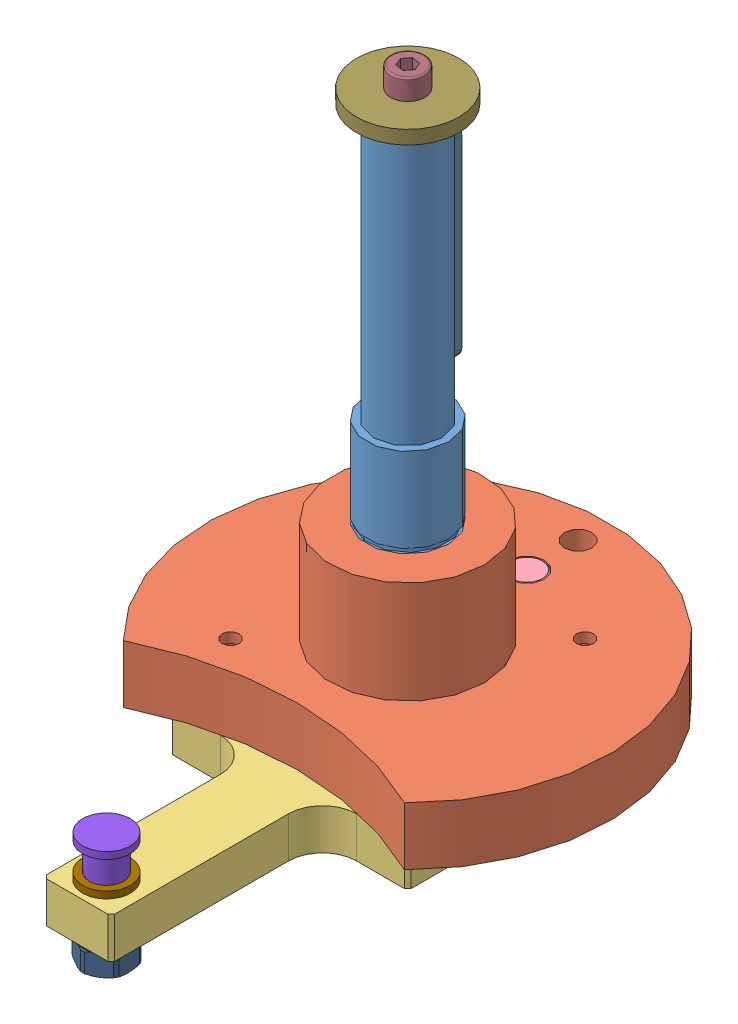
SolidWorks assembly Moteur.SLDASM, configuration Défaut (file format 10000). Lengths in mm.
Overall size (118 193 158.75).
18 component instances, 15 part files, 40 mates.
Components (placement in the parent):
- arbre moteur-1: arbre moteur.SLDPRT [Défaut] at (0 -13 0) x (0 1 0) z (-1 0 0) size (164 48 48)
- indexeur-1: indexeur.SLDPRT [Défaut] at (0 -12 0) x (0 1 0) z (1 0 0) size (59 101.2 118)
- maneton-1: maneton.SLDPRT [Défaut] at (35 0 -35) x (0 0 1) z (0 -1 0) size (155 70 12)
- goupille D10-1: goupille D10.SLDPRT [Défaut] at (0 17 -35) x (0 0 -1) z (0 -1 0) size (10 10 28)
- capteur-1: capteur.SLDPRT [Défaut] at (0 -24 0) x (0 0 -1) z (0 1 0) size (58 46 12)
- doigt-1: doigt.SLDPRT [Défaut] at (0 -30 -50) x (0 1 0) z (0.507753 0 0.861503) size (26 16 16)
- vis M6x30-1: vis M6x30.SLDPRT [Défaut] at (0 6 -16) x (-0.924225 0 0.381849) z (0 -1 0) size (10 10 36)
- axe galet-1: axe galet.SLDPRT [Défaut] at (0 12 88.39) x (0 -1 0) z (0.892576 0 -0.450897) size (34 14 14)
- rondelle galet-1: rondelle galet.SLDPRT [Défaut] at (0 0 88.39) x (0 1 0) z (0 0 1) size (2 14 14)
- rondelle galet-2: rondelle galet.SLDPRT [Défaut] at (0 -14 88.39) x (0 1 0) z (0 0 1) size (2 14 14)
- ecrou M8-1: ecrou M8.SLDPRT [Défaut] at (0 -20.5 88.39) x (0.852634 0 -0.522509) z (0 1 0) size (14.4 13 6.5)
- vis M6x20-1: vis M6x20.SLDPRT [Défaut] at (-26 14 26) x (-0.478555 0 0.878058) z (0 -1 0) size (10 10 26)
- vis M6x20-2: vis M6x20.SLDPRT [Défaut] at (26 14 -26) x (-0.999469 0 -0.032585) z (0 -1 0) size (10 10 26)
- rondelle arbre moteur-1: rondelle arbre moteur.SLDPRT [Défaut] at (0.4822 153 0.1323) x (0 1 0) z (-0.264518 0 0.964381) size (4 30 30)
- vis M6x15-1: vis M6x15.SLDPRT [Défaut] at (0 142 0) x (0.133131 0 -0.991098) z (0 1 0) size (10 10 21)
- clavette-1: clavette.SLDPRT [Défaut] at (3 143 -6.8544) x (-1 0 0) z (0 -1 0) size (6 6 60)
- goupille D6-1: goupille D6.SLDPRT [Défaut] at (16 -24 -7) x (0 0 -1) z (0 1 0) size (6 6 30)
- goupille D6-2: goupille D6.SLDPRT [Défaut] at (-16 -24 -7) x (0 0 -1) z (0 1 0) size (6 6 30)
Mates (geometry in assembly coordinates):
- Coaxial1: concentric aligned: cylinder of arbre moteur-1 through (0 -13 0) axis (0 -1 0) radius 12; cylinder of indexeur-1 through (0 -62 0) axis (0 -1 0) radius 12
- Coïncidente1: coincident anti-aligned: plane of arbre moteur-1 through (0 7 24) normal (0 1 0); plane of indexeur-1 through (0 7 -12) normal (0 -1 0)
- Coaxial2: concentric anti-aligned: cylinder of indexeur-1 through (0 -62 0) axis (0 -1 0) radius 28; cylinder of maneton-1 through (0 -12 0) axis (0 1 0) radius 28
- Coaxial3: concentric aligned: cylinder of indexeur-1 through (0 47 35) axis (0 -1 0) radius 5; cylinder of maneton-1 through (0 0 35) axis (0 -1 0) radius 5
- Coïncidente2: coincident anti-aligned: plane of indexeur-1 through (0 0 -28) normal (0 -1 0); plane of maneton-1 through (-20 0 -45) normal (0 1 0)
- Coaxial4: concentric anti-aligned: cylinder of indexeur-1 through (0 47 35) axis (0 -1 0) radius 5; cylinder of goupille D10-1 through (0 -11 35) axis (0 1 0) radius 5
- Coïncidente3: coincident aligned: plane of indexeur-1 through (0 17 -59) normal (0 1 0); plane of goupille D10-1 through (0 17 35) normal (0 1 0)
- Coaxial5: concentric anti-aligned: cylinder of maneton-1 through (0 0 50) axis (0 -1 0) radius 4; cylinder of capteur-1 through (0 -24 50) axis (0 1 0) radius 4
- Coaxial6: concentric anti-aligned: cylinder of arbre moteur-1 through (-16 151 7) axis (0 -1 0) radius 3; cylinder of capteur-1 through (-16 -24 7) axis (0 1 0) radius 3
- Coïncidente4: coincident anti-aligned: plane of maneton-1 through (-20 -12 -45) normal (0 -1 0); plane of capteur-1 through (-12 -12 23) normal (0 1 0)
- Coaxial7: concentric anti-aligned: cylinder of capteur-1 through (0 -24 50) axis (0 1 0) radius 4; cylinder of doigt-1 through (0 -34.1802 50) axis (0 -1 0) radius 4
- Coïncidente5: coincident anti-aligned: plane of capteur-1 through (-12 -24 23) normal (0 -1 0); plane of doigt-1 through (-5.169 -24 53.0465) normal (0 1 0)
- Coïncidente6: coincident anti-aligned: plane of capteur-1 through (-12 -24 23) normal (0 -1 0); plane of vis M6x30-1 through (0 -24 16) normal (0 1 0)
- Coaxial11: concentric aligned: cylinder of maneton-1 through (0 0 -88.39) axis (0 -1 0) radius 5; cylinder of rondelle galet-1 through (0 -12.5747 -88.39) axis (0 -1 0) radius 4
- Coïncidente8: coincident anti-aligned: plane of maneton-1 through (-20 0 -45) normal (0 1 0); plane of rondelle galet-1 through (-4 0 -88.39) normal (0 -1 0)
- Coaxial12: concentric anti-aligned: cylinder of axe galet-1 through (0 24.5747 -88.39) axis (0 1 0) radius 4; cylinder of rondelle galet-1 through (0 -12.5747 -88.39) axis (0 -1 0) radius 4
- Coïncidente9: coincident anti-aligned: plane of axe galet-1 through (-2.2545 2 -92.8529) normal (0 -1 0); plane of rondelle galet-1 through (-7 2 -88.39) normal (0 1 0)
- Coaxial14: concentric anti-aligned: cylinder of axe galet-1 through (0 24.5747 -88.39) axis (0 1 0) radius 4; cylinder of rondelle galet-2 through (0 -26.5747 -88.39) axis (0 -1 0) radius 4
- Coïncidente10: coincident anti-aligned: plane of maneton-1 through (-20 -12 -45) normal (0 -1 0); plane of rondelle galet-2 through (-7 -12 -88.39) normal (0 1 0)
- Coaxial15: concentric anti-aligned: cylinder of axe galet-1 through (0 24.5747 -88.39) axis (0 1 0) radius 4; cylinder of ecrou M8-1 through (0 -14 -88.39) axis (0 -1 0) radius 3.3757
- Coïncidente11: coincident anti-aligned: plane of rondelle galet-2 through (-4 -14 -88.39) normal (0 -1 0); plane of ecrou M8-1 through (0 -14 -88.39) normal (0 1 0)
- Coaxial16: concentric anti-aligned: cylinder of indexeur-1 through (26 47 -26) axis (0 -1 0) radius 2.5; cylinder of vis M6x20-1 through (26 -6 -26) axis (0 1 0) radius 3
- Coaxial17: concentric anti-aligned: cylinder of indexeur-1 through (-26 47 26) axis (0 -1 0) radius 2.5; cylinder of vis M6x20-2 through (-26 -6 26) axis (0 1 0) radius 3
- Coïncidente12: coincident anti-aligned: plane of maneton-1 through (-26 -6 22.7) normal (0 -1 0); plane of vis M6x20-2 through (-26 -6 26) normal (0 1 0)
- Coïncidente13: coincident anti-aligned: plane of maneton-1 through (26 -6 -29.3) normal (0 -1 0); plane of vis M6x20-1 through (26 -6 -26) normal (0 1 0)
- Coaxial18: concentric anti-aligned: cylinder of arbre moteur-1 through (0 151 0) axis (0 1 0) radius 3; cylinder of rondelle arbre moteur-1 through (0 140.4253 0) axis (0 -1 0) radius 3.5
- A distance1: distance = 80 mm anti-aligned: plane of arbre moteur-1 through (0 73 -12) normal (0 1 0); plane of rondelle arbre moteur-1 through (-3.3753 153 -0.9258) normal (0 -1 0)
- Coaxial19: concentric anti-aligned: cylinder of arbre moteur-1 through (0 151 0) axis (0 1 0) radius 3; cylinder of vis M6x15-1 through (0 157 0) axis (0 -1 0) radius 3
- Coïncidente14: coincident anti-aligned: plane of rondelle arbre moteur-1 through (-14.4657 157 -3.9678) normal (0 1 0); plane of vis M6x15-1 through (0 157 0) normal (0 -1 0)
- Coïncidente15: coincident anti-aligned: plane of arbre moteur-1 through (-3 83 6.8544) normal (0 0 1); plane of clavette-1 through (-3 83 6.8544) normal (0 0 -1)
- Coïncidente16: coincident anti-aligned: plane of arbre moteur-1 through (3 83 10) normal (-1 0 0); plane of clavette-1 through (3 83 6.8544) normal (1 0 0)
- Coïncidente17: coincident aligned: line of arbre moteur-1 through (0 143 6.8544) axis (0 0 1); line of clavette-1 through (0 143 6.8544) axis (0 0 1)
- Coaxial20: concentric aligned: cylinder of capteur-1 through (0 -24 16) axis (0 1 0) radius 3.25; cylinder of vis M6x30-1 through (0 -24 16) axis (0 1 0) radius 3
- Coaxial21: concentric anti-aligned: cylinder of capteur-1 through (-16 -24 7) axis (0 1 0) radius 3; cylinder of goupille D6-1 through (-16 6 7) axis (0 -1 0) radius 3
- Coaxial22: concentric anti-aligned: cylinder of capteur-1 through (16 -24 7) axis (0 1 0) radius 3; cylinder of goupille D6-2 through (16 6 7) axis (0 -1 0) radius 3
- Coïncidente18: coincident: plane of capteur-1 through (-12 -24 23) normal (0 -1 0); point of goupille D6-1
- Coïncidente19: coincident: plane of capteur-1 through (-12 -24 23) normal (0 -1 0); point of goupille D6-2
- Coïncidente20: coincident anti-aligned: plane of ? through (0 0 -28) normal (0 -1 0)
- Coaxiale1: concentric: cylinder of ? through (0 -13 0) axis (0 -1 0) radius 12
- Coïncidente22: coincident aligned: plane of capteur-1 through (-10 -12 0) normal (0 0 1); plane of assembly
